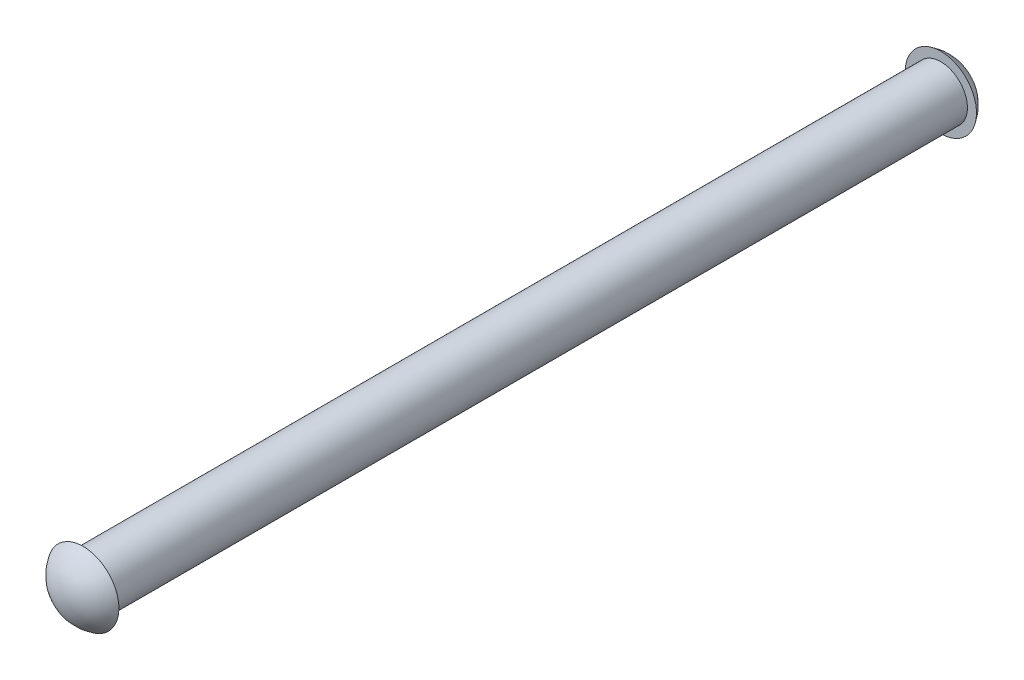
ISO-10303-21;
HEADER;
FILE_DESCRIPTION(('STEP AP214'),'2;1');
FILE_NAME('part.step','',(''),(''),'','','');
FILE_SCHEMA(('AUTOMOTIVE_DESIGN { 1 0 10303 214 1 1 1 1 }'));
ENDSEC;
DATA;
#1=APPLICATION_CONTEXT('core data for automotive mechanical design processes');
#2=APPLICATION_PROTOCOL_DEFINITION('international standard','automotive_design',2000,#1);
#3=PRODUCT_CONTEXT('',#1,'mechanical');
#4=PRODUCT('Part','Part','',(#3));
#5=PRODUCT_RELATED_PRODUCT_CATEGORY('part','',(#4));
#6=PRODUCT_DEFINITION_FORMATION('','',#4);
#7=PRODUCT_DEFINITION_CONTEXT('part definition',#1,'design');
#8=PRODUCT_DEFINITION('design','',#6,#7);
#9=PRODUCT_DEFINITION_SHAPE('','',#8);
#10=(LENGTH_UNIT() NAMED_UNIT(*) SI_UNIT(.MILLI.,.METRE.));
#11=(NAMED_UNIT(*) PLANE_ANGLE_UNIT() SI_UNIT($,.RADIAN.));
#12=(NAMED_UNIT(*) SI_UNIT($,.STERADIAN.) SOLID_ANGLE_UNIT());
#13=UNCERTAINTY_MEASURE_WITH_UNIT(LENGTH_MEASURE(1.E-05),#10,'distance_accuracy_value','');
#14=(GEOMETRIC_REPRESENTATION_CONTEXT(3) GLOBAL_UNCERTAINTY_ASSIGNED_CONTEXT((#13)) GLOBAL_UNIT_ASSIGNED_CONTEXT((#10,
#11,#12)) REPRESENTATION_CONTEXT('',''));
#15=CARTESIAN_POINT('',(0.,0.,0.));
#16=DIRECTION('',(0.,0.,1.));
#17=DIRECTION('',(1.,0.,0.));
#18=AXIS2_PLACEMENT_3D('',#15,#16,#17);
#19=CARTESIAN_POINT('',(0.,0.,0.));
#20=DIRECTION('',(0.,0.,-1.));
#21=DIRECTION('',(-1.,0.,0.));
#22=AXIS2_PLACEMENT_3D('',#19,#20,#21);
#23=CYLINDRICAL_SURFACE('',#22,2.5);
#24=CARTESIAN_POINT('',(0.,0.,40.25));
#25=DIRECTION('',(0.,0.,-1.));
#26=DIRECTION('',(-1.,0.,0.));
#27=AXIS2_PLACEMENT_3D('',#24,#25,#26);
#28=CIRCLE('',#27,2.5);
#29=CARTESIAN_POINT('',(-2.5,0.,40.25));
#30=VERTEX_POINT('',#29);
#31=EDGE_CURVE('E10',#30,#30,#28,.T.);
#32=ORIENTED_EDGE('',*,*,#31,.T.);
#33=EDGE_LOOP('',(#32));
#34=FACE_BOUND('',#33,.T.);
#35=CARTESIAN_POINT('',(0.,0.,-40.25));
#36=DIRECTION('',(0.,0.,-1.));
#37=DIRECTION('',(-1.,0.,0.));
#38=AXIS2_PLACEMENT_3D('',#35,#36,#37);
#39=CIRCLE('',#38,2.5);
#40=CARTESIAN_POINT('',(-2.5,0.,-40.25));
#41=VERTEX_POINT('',#40);
#42=EDGE_CURVE('E46',#41,#41,#39,.T.);
#43=ORIENTED_EDGE('',*,*,#42,.F.);
#44=EDGE_LOOP('',(#43));
#45=FACE_BOUND('',#44,.T.);
#46=ADVANCED_FACE('F36',(#34,#45),#23,.T.);
#47=CARTESIAN_POINT('',(0.,3.35,40.25));
#48=DIRECTION('',(0.,0.,-1.));
#49=DIRECTION('',(-1.,0.,0.));
#50=AXIS2_PLACEMENT_3D('',#47,#48,#49);
#51=PLANE('',#50);
#52=CARTESIAN_POINT('',(0.,0.,40.25));
#53=DIRECTION('',(0.,0.,-1.));
#54=DIRECTION('',(-1.,0.,0.));
#55=AXIS2_PLACEMENT_3D('',#52,#53,#54);
#56=CIRCLE('',#55,3.35);
#57=CARTESIAN_POINT('',(-3.35,0.,40.25));
#58=VERTEX_POINT('',#57);
#59=EDGE_CURVE('E42',#58,#58,#56,.T.);
#60=ORIENTED_EDGE('',*,*,#59,.T.);
#61=EDGE_LOOP('',(#60));
#62=FACE_BOUND('',#61,.T.);
#63=ORIENTED_EDGE('',*,*,#31,.F.);
#64=EDGE_LOOP('',(#63));
#65=FACE_BOUND('',#64,.T.);
#66=ADVANCED_FACE('F66',(#62,#65),#51,.T.);
#67=CARTESIAN_POINT('',(0.,0.,38.2467105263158));
#68=DIRECTION('',(0.,0.,-1.));
#69=DIRECTION('',(0.,1.,0.));
#70=AXIS2_PLACEMENT_3D('',#67,#68,#69);
#71=SPHERICAL_SURFACE('',#70,3.90328947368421);
#72=ORIENTED_EDGE('',*,*,#59,.F.);
#73=EDGE_LOOP('',(#72));
#74=FACE_BOUND('',#73,.T.);
#75=ADVANCED_FACE('F61',(#74),#71,.T.);
#76=CARTESIAN_POINT('',(0.,3.35,-40.25));
#77=DIRECTION('',(0.,0.,1.));
#78=DIRECTION('',(-1.,0.,0.));
#79=AXIS2_PLACEMENT_3D('',#76,#77,#78);
#80=PLANE('',#79);
#81=CARTESIAN_POINT('',(0.,0.,-40.25));
#82=DIRECTION('',(0.,0.,-1.));
#83=DIRECTION('',(-1.,0.,0.));
#84=AXIS2_PLACEMENT_3D('',#81,#82,#83);
#85=CIRCLE('',#84,3.35);
#86=CARTESIAN_POINT('',(-3.35,0.,-40.25));
#87=VERTEX_POINT('',#86);
#88=EDGE_CURVE('E50',#87,#87,#85,.T.);
#89=ORIENTED_EDGE('',*,*,#88,.F.);
#90=EDGE_LOOP('',(#89));
#91=FACE_BOUND('',#90,.T.);
#92=ORIENTED_EDGE('',*,*,#42,.T.);
#93=EDGE_LOOP('',(#92));
#94=FACE_BOUND('',#93,.T.);
#95=ADVANCED_FACE('F58',(#91,#94),#80,.T.);
#96=CARTESIAN_POINT('',(0.,0.,-38.2467105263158));
#97=DIRECTION('',(0.,0.,1.));
#98=DIRECTION('',(0.,1.,0.));
#99=AXIS2_PLACEMENT_3D('',#96,#97,#98);
#100=SPHERICAL_SURFACE('',#99,3.90328947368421);
#101=ORIENTED_EDGE('',*,*,#88,.T.);
#102=EDGE_LOOP('',(#101));
#103=FACE_BOUND('',#102,.T.);
#104=ADVANCED_FACE('F56',(#103),#100,.T.);
#105=CLOSED_SHELL('',(#46,#66,#75,#95,#104));
#106=MANIFOLD_SOLID_BREP('B2',#105);
#107=ADVANCED_BREP_SHAPE_REPRESENTATION('',(#18,#106),#14);
#108=SHAPE_DEFINITION_REPRESENTATION(#9,#107);
ENDSEC;
END-ISO-10303-21;
